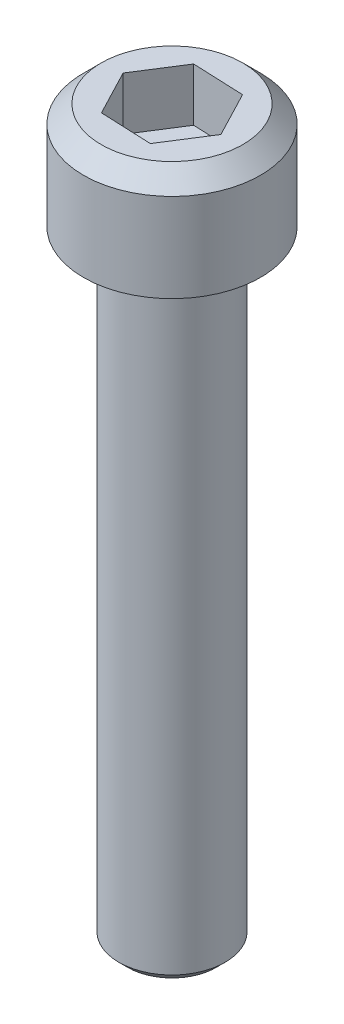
ISO-10303-21;
HEADER;
FILE_DESCRIPTION(('STEP AP214'),'2;1');
FILE_NAME('part.step','',(''),(''),'','','');
FILE_SCHEMA(('AUTOMOTIVE_DESIGN { 1 0 10303 214 1 1 1 1 }'));
ENDSEC;
DATA;
#1=APPLICATION_CONTEXT('core data for automotive mechanical design processes');
#2=APPLICATION_PROTOCOL_DEFINITION('international standard','automotive_design',2000,#1);
#3=PRODUCT_CONTEXT('',#1,'mechanical');
#4=PRODUCT('Part','Part','',(#3));
#5=PRODUCT_RELATED_PRODUCT_CATEGORY('part','',(#4));
#6=PRODUCT_DEFINITION_FORMATION('','',#4);
#7=PRODUCT_DEFINITION_CONTEXT('part definition',#1,'design');
#8=PRODUCT_DEFINITION('design','',#6,#7);
#9=PRODUCT_DEFINITION_SHAPE('','',#8);
#10=(LENGTH_UNIT() NAMED_UNIT(*) SI_UNIT(.MILLI.,.METRE.));
#11=(NAMED_UNIT(*) PLANE_ANGLE_UNIT() SI_UNIT($,.RADIAN.));
#12=(NAMED_UNIT(*) SI_UNIT($,.STERADIAN.) SOLID_ANGLE_UNIT());
#13=UNCERTAINTY_MEASURE_WITH_UNIT(LENGTH_MEASURE(1.E-05),#10,'distance_accuracy_value','');
#14=(GEOMETRIC_REPRESENTATION_CONTEXT(3) GLOBAL_UNCERTAINTY_ASSIGNED_CONTEXT((#13)) GLOBAL_UNIT_ASSIGNED_CONTEXT((#10,
#11,#12)) REPRESENTATION_CONTEXT('',''));
#15=CARTESIAN_POINT('',(0.,0.,0.));
#16=DIRECTION('',(0.,0.,1.));
#17=DIRECTION('',(1.,0.,0.));
#18=AXIS2_PLACEMENT_3D('',#15,#16,#17);
#19=CARTESIAN_POINT('',(-2.884136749,3.,2.559153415));
#20=DIRECTION('',(0.,-1.,0.));
#21=DIRECTION('',(0.,0.,-1.));
#22=AXIS2_PLACEMENT_3D('',#19,#20,#21);
#23=PLANE('',#22);
#24=DIRECTION('',(0.999094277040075,0.,0.0425514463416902));
#25=VECTOR('',#24,1.);
#26=CARTESIAN_POINT('',(-0.1063786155,3.,2.4977356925));
#27=LINE('',#26,#25);
#28=CARTESIAN_POINT('',(-1.54844698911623,3.,2.43631797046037));
#29=VERTEX_POINT('',#28);
#30=CARTESIAN_POINT('',(1.33568975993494,3.,2.55915341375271));
#31=VERTEX_POINT('',#30);
#32=EDGE_CURVE('E64',#29,#31,#27,.T.);
#33=ORIENTED_EDGE('',*,*,#32,.T.);
#34=DIRECTION('',(0.536397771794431,0.,-0.843965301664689));
#35=VECTOR('',#34,1.);
#36=CARTESIAN_POINT('',(2.109913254,3.,1.3409944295));
#37=LINE('',#36,#35);
#38=CARTESIAN_POINT('',(2.88413674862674,3.,0.122835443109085));
#39=VERTEX_POINT('',#38);
#40=EDGE_CURVE('E77',#31,#39,#37,.T.);
#41=ORIENTED_EDGE('',*,*,#40,.T.);
#42=DIRECTION('',(-0.462696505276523,0.,-0.886516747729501));
#43=VECTOR('',#42,1.);
#44=CARTESIAN_POINT('',(2.2162918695,3.,-1.156741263));
#45=LINE('',#44,#43);
#46=CARTESIAN_POINT('',(1.54844698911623,3.,-2.43631797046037));
#47=VERTEX_POINT('',#46);
#48=EDGE_CURVE('E75',#39,#47,#45,.T.);
#49=ORIENTED_EDGE('',*,*,#48,.T.);
#50=DIRECTION('',(-0.999094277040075,0.,-0.0425514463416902));
#51=VECTOR('',#50,1.);
#52=CARTESIAN_POINT('',(0.1063786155,3.,-2.4977356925));
#53=LINE('',#52,#51);
#54=CARTESIAN_POINT('',(-1.33568975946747,3.,-2.55915341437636));
#55=VERTEX_POINT('',#54);
#56=EDGE_CURVE('E92',#47,#55,#53,.T.);
#57=ORIENTED_EDGE('',*,*,#56,.T.);
#58=DIRECTION('',(-0.536397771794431,0.,0.843965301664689));
#59=VECTOR('',#58,1.);
#60=CARTESIAN_POINT('',(-2.109913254,3.,-1.3409944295));
#61=LINE('',#60,#59);
#62=CARTESIAN_POINT('',(-2.88413674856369,3.,-0.122835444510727));
#63=VERTEX_POINT('',#62);
#64=EDGE_CURVE('E101',#55,#63,#61,.T.);
#65=ORIENTED_EDGE('',*,*,#64,.T.);
#66=DIRECTION('',(0.462696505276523,0.,0.886516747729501));
#67=VECTOR('',#66,1.);
#68=CARTESIAN_POINT('',(-2.2162918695,3.,1.156741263));
#69=LINE('',#68,#67);
#70=EDGE_CURVE('E100',#63,#29,#69,.T.);
#71=ORIENTED_EDGE('',*,*,#70,.T.);
#72=EDGE_LOOP('',(#33,#41,#49,#57,#65,#71));
#73=FACE_BOUND('',#72,.T.);
#74=ADVANCED_FACE('F16',(#73),#23,.F.);
#75=CARTESIAN_POINT('',(1.335689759,3.,2.559153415));
#76=DIRECTION('',(0.843965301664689,0.,0.536397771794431));
#77=DIRECTION('',(0.536397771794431,0.,-0.843965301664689));
#78=AXIS2_PLACEMENT_3D('',#75,#76,#77);
#79=PLANE('',#78);
#80=DIRECTION('',(0.,-1.,0.));
#81=VECTOR('',#80,1.);
#82=CARTESIAN_POINT('',(2.884136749,4.5,0.122835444));
#83=LINE('',#82,#81);
#84=CARTESIAN_POINT('',(2.884136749,6.,0.122835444));
#85=VERTEX_POINT('',#84);
#86=EDGE_CURVE('E79',#85,#39,#83,.T.);
#87=ORIENTED_EDGE('',*,*,#86,.T.);
#88=ORIENTED_EDGE('',*,*,#40,.F.);
#89=DIRECTION('',(0.,1.,0.));
#90=VECTOR('',#89,1.);
#91=CARTESIAN_POINT('',(1.335689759,4.5,2.559153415));
#92=LINE('',#91,#90);
#93=CARTESIAN_POINT('',(1.335689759,6.,2.559153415));
#94=VERTEX_POINT('',#93);
#95=EDGE_CURVE('E55',#31,#94,#92,.T.);
#96=ORIENTED_EDGE('',*,*,#95,.T.);
#97=DIRECTION('',(0.536397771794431,0.,-0.843965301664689));
#98=VECTOR('',#97,1.);
#99=CARTESIAN_POINT('',(1.335689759,6.,2.559153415));
#100=LINE('',#99,#98);
#101=EDGE_CURVE('E20',#94,#85,#100,.T.);
#102=ORIENTED_EDGE('',*,*,#101,.T.);
#103=EDGE_LOOP('',(#87,#88,#96,#102));
#104=FACE_BOUND('',#103,.T.);
#105=ADVANCED_FACE('F82',(#104),#79,.F.);
#106=CARTESIAN_POINT('',(2.884136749,3.,0.122835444));
#107=DIRECTION('',(0.886516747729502,0.,-0.462696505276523));
#108=DIRECTION('',(-0.462696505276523,0.,-0.886516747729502));
#109=AXIS2_PLACEMENT_3D('',#106,#107,#108);
#110=PLANE('',#109);
#111=DIRECTION('',(0.,-1.,0.));
#112=VECTOR('',#111,1.);
#113=CARTESIAN_POINT('',(1.54844699,4.5,-2.43631797));
#114=LINE('',#113,#112);
#115=CARTESIAN_POINT('',(1.54844699,6.,-2.43631797));
#116=VERTEX_POINT('',#115);
#117=EDGE_CURVE('E89',#116,#47,#114,.T.);
#118=ORIENTED_EDGE('',*,*,#117,.T.);
#119=ORIENTED_EDGE('',*,*,#48,.F.);
#120=ORIENTED_EDGE('',*,*,#86,.F.);
#121=DIRECTION('',(-0.462696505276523,0.,-0.886516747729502));
#122=VECTOR('',#121,1.);
#123=CARTESIAN_POINT('',(2.884136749,6.,0.122835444));
#124=LINE('',#123,#122);
#125=EDGE_CURVE('E126',#85,#116,#124,.T.);
#126=ORIENTED_EDGE('',*,*,#125,.T.);
#127=EDGE_LOOP('',(#118,#119,#120,#126));
#128=FACE_BOUND('',#127,.T.);
#129=ADVANCED_FACE('F87',(#128),#110,.F.);
#130=CARTESIAN_POINT('',(1.54844699,3.,-2.43631797));
#131=DIRECTION('',(0.0425514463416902,0.,-0.999094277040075));
#132=DIRECTION('',(-0.999094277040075,0.,-0.0425514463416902));
#133=AXIS2_PLACEMENT_3D('',#130,#131,#132);
#134=PLANE('',#133);
#135=DIRECTION('',(0.,-1.,0.));
#136=VECTOR('',#135,1.);
#137=CARTESIAN_POINT('',(-1.335689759,4.5,-2.559153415));
#138=LINE('',#137,#136);
#139=CARTESIAN_POINT('',(-1.335689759,6.,-2.559153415));
#140=VERTEX_POINT('',#139);
#141=EDGE_CURVE('E104',#140,#55,#138,.T.);
#142=ORIENTED_EDGE('',*,*,#141,.T.);
#143=ORIENTED_EDGE('',*,*,#56,.F.);
#144=ORIENTED_EDGE('',*,*,#117,.F.);
#145=DIRECTION('',(-0.999094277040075,0.,-0.0425514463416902));
#146=VECTOR('',#145,1.);
#147=CARTESIAN_POINT('',(1.54844699,6.,-2.43631797));
#148=LINE('',#147,#146);
#149=EDGE_CURVE('E125',#116,#140,#148,.T.);
#150=ORIENTED_EDGE('',*,*,#149,.T.);
#151=EDGE_LOOP('',(#142,#143,#144,#150));
#152=FACE_BOUND('',#151,.T.);
#153=ADVANCED_FACE('F130',(#152),#134,.F.);
#154=CARTESIAN_POINT('',(-1.335689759,3.,-2.559153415));
#155=DIRECTION('',(-0.843965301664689,0.,-0.536397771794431));
#156=DIRECTION('',(-0.536397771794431,0.,0.843965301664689));
#157=AXIS2_PLACEMENT_3D('',#154,#155,#156);
#158=PLANE('',#157);
#159=DIRECTION('',(0.,-1.,0.));
#160=VECTOR('',#159,1.);
#161=CARTESIAN_POINT('',(-2.884136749,4.5,-0.122835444));
#162=LINE('',#161,#160);
#163=CARTESIAN_POINT('',(-2.884136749,6.,-0.122835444));
#164=VERTEX_POINT('',#163);
#165=EDGE_CURVE('E97',#164,#63,#162,.T.);
#166=ORIENTED_EDGE('',*,*,#165,.T.);
#167=ORIENTED_EDGE('',*,*,#64,.F.);
#168=ORIENTED_EDGE('',*,*,#141,.F.);
#169=DIRECTION('',(-0.536397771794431,0.,0.843965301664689));
#170=VECTOR('',#169,1.);
#171=CARTESIAN_POINT('',(-1.335689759,6.,-2.559153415));
#172=LINE('',#171,#170);
#173=EDGE_CURVE('E123',#140,#164,#172,.T.);
#174=ORIENTED_EDGE('',*,*,#173,.T.);
#175=EDGE_LOOP('',(#166,#167,#168,#174));
#176=FACE_BOUND('',#175,.T.);
#177=ADVANCED_FACE('F137',(#176),#158,.F.);
#178=CARTESIAN_POINT('',(-2.884136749,3.,-0.122835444));
#179=DIRECTION('',(-0.886516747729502,0.,0.462696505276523));
#180=DIRECTION('',(0.462696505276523,0.,0.886516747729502));
#181=AXIS2_PLACEMENT_3D('',#178,#179,#180);
#182=PLANE('',#181);
#183=DIRECTION('',(0.,-1.,0.));
#184=VECTOR('',#183,1.);
#185=CARTESIAN_POINT('',(-1.54844699,4.5,2.43631797));
#186=LINE('',#185,#184);
#187=CARTESIAN_POINT('',(-1.54844699,6.,2.43631797));
#188=VERTEX_POINT('',#187);
#189=EDGE_CURVE('E102',#188,#29,#186,.T.);
#190=ORIENTED_EDGE('',*,*,#189,.T.);
#191=ORIENTED_EDGE('',*,*,#70,.F.);
#192=ORIENTED_EDGE('',*,*,#165,.F.);
#193=DIRECTION('',(0.462696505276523,0.,0.886516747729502));
#194=VECTOR('',#193,1.);
#195=CARTESIAN_POINT('',(-2.884136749,6.,-0.122835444));
#196=LINE('',#195,#194);
#197=EDGE_CURVE('E35',#164,#188,#196,.T.);
#198=ORIENTED_EDGE('',*,*,#197,.T.);
#199=EDGE_LOOP('',(#190,#191,#192,#198));
#200=FACE_BOUND('',#199,.T.);
#201=ADVANCED_FACE('F140',(#200),#182,.F.);
#202=CARTESIAN_POINT('',(-1.54844699,3.,2.43631797));
#203=DIRECTION('',(-0.0425514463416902,0.,0.999094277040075));
#204=DIRECTION('',(0.999094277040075,0.,0.0425514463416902));
#205=AXIS2_PLACEMENT_3D('',#202,#203,#204);
#206=PLANE('',#205);
#207=ORIENTED_EDGE('',*,*,#95,.F.);
#208=ORIENTED_EDGE('',*,*,#32,.F.);
#209=ORIENTED_EDGE('',*,*,#189,.F.);
#210=DIRECTION('',(0.999094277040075,0.,0.0425514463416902));
#211=VECTOR('',#210,1.);
#212=CARTESIAN_POINT('',(-1.54844699,6.,2.43631797));
#213=LINE('',#212,#211);
#214=EDGE_CURVE('E120',#188,#94,#213,.T.);
#215=ORIENTED_EDGE('',*,*,#214,.T.);
#216=EDGE_LOOP('',(#207,#208,#209,#215));
#217=FACE_BOUND('',#216,.T.);
#218=ADVANCED_FACE('F191',(#217),#206,.F.);
#219=CARTESIAN_POINT('',(-4.048,6.,4.048));
#220=DIRECTION('',(0.,-1.,0.));
#221=DIRECTION('',(0.,0.,-1.));
#222=AXIS2_PLACEMENT_3D('',#219,#220,#221);
#223=PLANE('',#222);
#224=ORIENTED_EDGE('',*,*,#197,.F.);
#225=ORIENTED_EDGE('',*,*,#173,.F.);
#226=ORIENTED_EDGE('',*,*,#149,.F.);
#227=ORIENTED_EDGE('',*,*,#125,.F.);
#228=ORIENTED_EDGE('',*,*,#101,.F.);
#229=ORIENTED_EDGE('',*,*,#214,.F.);
#230=EDGE_LOOP('',(#224,#225,#226,#227,#228,#229));
#231=FACE_BOUND('',#230,.T.);
#232=CARTESIAN_POINT('',(0.,6.00000000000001,0.));
#233=DIRECTION('',(0.,-1.,0.));
#234=DIRECTION('',(0.,0.,-1.));
#235=AXIS2_PLACEMENT_3D('',#232,#233,#234);
#236=CIRCLE('',#235,3.99999999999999);
#237=CARTESIAN_POINT('',(0.,6.00000000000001,-3.99999999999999));
#238=VERTEX_POINT('',#237);
#239=EDGE_CURVE('E117',#238,#238,#236,.F.);
#240=ORIENTED_EDGE('',*,*,#239,.T.);
#241=EDGE_LOOP('',(#240));
#242=FACE_BOUND('',#241,.T.);
#243=ADVANCED_FACE('F133',(#231,#242),#223,.F.);
#244=CARTESIAN_POINT('',(0.,6.,0.));
#245=DIRECTION('',(0.,-1.,0.));
#246=DIRECTION('',(0.,0.,-1.));
#247=AXIS2_PLACEMENT_3D('',#244,#245,#246);
#248=CONICAL_SURFACE('',#247,4.,0.785398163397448);
#249=CARTESIAN_POINT('',(0.,5.,0.));
#250=DIRECTION('',(0.,1.,0.));
#251=DIRECTION('',(0.,0.,1.));
#252=AXIS2_PLACEMENT_3D('',#249,#250,#251);
#253=CIRCLE('',#252,5.);
#254=CARTESIAN_POINT('',(0.,5.,5.));
#255=VERTEX_POINT('',#254);
#256=EDGE_CURVE('E116',#255,#255,#253,.T.);
#257=ORIENTED_EDGE('',*,*,#256,.T.);
#258=EDGE_LOOP('',(#257));
#259=FACE_BOUND('',#258,.T.);
#260=ORIENTED_EDGE('',*,*,#239,.F.);
#261=EDGE_LOOP('',(#260));
#262=FACE_BOUND('',#261,.T.);
#263=ADVANCED_FACE('F147',(#259,#262),#248,.T.);
#264=CARTESIAN_POINT('',(0.,0.,0.));
#265=DIRECTION('',(0.,1.,0.));
#266=DIRECTION('',(0.,0.,1.));
#267=AXIS2_PLACEMENT_3D('',#264,#265,#266);
#268=CYLINDRICAL_SURFACE('',#267,5.);
#269=ORIENTED_EDGE('',*,*,#256,.F.);
#270=EDGE_LOOP('',(#269));
#271=FACE_BOUND('',#270,.T.);
#272=CARTESIAN_POINT('',(0.,0.,0.));
#273=DIRECTION('',(0.,1.,0.));
#274=DIRECTION('',(0.,0.,1.));
#275=AXIS2_PLACEMENT_3D('',#272,#273,#274);
#276=CIRCLE('',#275,5.);
#277=CARTESIAN_POINT('',(0.,0.,5.));
#278=VERTEX_POINT('',#277);
#279=EDGE_CURVE('E113',#278,#278,#276,.T.);
#280=ORIENTED_EDGE('',*,*,#279,.T.);
#281=EDGE_LOOP('',(#280));
#282=FACE_BOUND('',#281,.T.);
#283=ADVANCED_FACE('F150',(#271,#282),#268,.T.);
#284=CARTESIAN_POINT('',(-2.53,-35.,-2.53));
#285=DIRECTION('',(0.,1.,0.));
#286=DIRECTION('',(0.,0.,1.));
#287=AXIS2_PLACEMENT_3D('',#284,#285,#286);
#288=PLANE('',#287);
#289=CARTESIAN_POINT('',(0.,-35.,0.));
#290=DIRECTION('',(0.,1.,0.));
#291=DIRECTION('',(0.,0.,1.));
#292=AXIS2_PLACEMENT_3D('',#289,#290,#291);
#293=CIRCLE('',#292,2.49999999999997);
#294=CARTESIAN_POINT('',(0.,-35.,2.49999999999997));
#295=VERTEX_POINT('',#294);
#296=EDGE_CURVE('E110',#295,#295,#293,.F.);
#297=ORIENTED_EDGE('',*,*,#296,.T.);
#298=EDGE_LOOP('',(#297));
#299=FACE_BOUND('',#298,.T.);
#300=ADVANCED_FACE('F153',(#299),#288,.F.);
#301=CARTESIAN_POINT('',(-5.06,0.,-5.06));
#302=DIRECTION('',(0.,1.,0.));
#303=DIRECTION('',(0.,0.,1.));
#304=AXIS2_PLACEMENT_3D('',#301,#302,#303);
#305=PLANE('',#304);
#306=CARTESIAN_POINT('',(0.,0.,0.));
#307=DIRECTION('',(0.,1.,0.));
#308=DIRECTION('',(0.,0.,1.));
#309=AXIS2_PLACEMENT_3D('',#306,#307,#308);
#310=CIRCLE('',#309,3.);
#311=CARTESIAN_POINT('',(0.,0.,3.));
#312=VERTEX_POINT('',#311);
#313=EDGE_CURVE('E26',#312,#312,#310,.T.);
#314=ORIENTED_EDGE('',*,*,#313,.T.);
#315=EDGE_LOOP('',(#314));
#316=FACE_BOUND('',#315,.T.);
#317=ORIENTED_EDGE('',*,*,#279,.F.);
#318=EDGE_LOOP('',(#317));
#319=FACE_BOUND('',#318,.T.);
#320=ADVANCED_FACE('F18',(#316,#319),#305,.F.);
#321=CARTESIAN_POINT('',(0.,-35.,0.));
#322=DIRECTION('',(0.,1.,0.));
#323=DIRECTION('',(0.,0.,1.));
#324=AXIS2_PLACEMENT_3D('',#321,#322,#323);
#325=CONICAL_SURFACE('',#324,2.5,0.785398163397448);
#326=ORIENTED_EDGE('',*,*,#296,.F.);
#327=EDGE_LOOP('',(#326));
#328=FACE_BOUND('',#327,.T.);
#329=CARTESIAN_POINT('',(0.,-34.5,0.));
#330=DIRECTION('',(0.,1.,0.));
#331=DIRECTION('',(0.,0.,1.));
#332=AXIS2_PLACEMENT_3D('',#329,#330,#331);
#333=CIRCLE('',#332,3.);
#334=CARTESIAN_POINT('',(0.,-34.5,3.));
#335=VERTEX_POINT('',#334);
#336=EDGE_CURVE('E11',#335,#335,#333,.F.);
#337=ORIENTED_EDGE('',*,*,#336,.T.);
#338=EDGE_LOOP('',(#337));
#339=FACE_BOUND('',#338,.T.);
#340=ADVANCED_FACE('F158',(#328,#339),#325,.T.);
#341=CARTESIAN_POINT('',(0.,-34.5,0.));
#342=DIRECTION('',(0.,1.,0.));
#343=DIRECTION('',(0.,0.,1.));
#344=AXIS2_PLACEMENT_3D('',#341,#342,#343);
#345=CYLINDRICAL_SURFACE('',#344,3.);
#346=ORIENTED_EDGE('',*,*,#313,.F.);
#347=EDGE_LOOP('',(#346));
#348=FACE_BOUND('',#347,.T.);
#349=ORIENTED_EDGE('',*,*,#336,.F.);
#350=EDGE_LOOP('',(#349));
#351=FACE_BOUND('',#350,.T.);
#352=ADVANCED_FACE('F165',(#348,#351),#345,.T.);
#353=CLOSED_SHELL('',(#74,#105,#129,#153,#177,#201,#218,#243,#263,#283,#300,#320,#340,#352));
#354=MANIFOLD_SOLID_BREP('B1',#353);
#355=ADVANCED_BREP_SHAPE_REPRESENTATION('',(#18,#354),#14);
#356=SHAPE_DEFINITION_REPRESENTATION(#9,#355);
ENDSEC;
END-ISO-10303-21;
